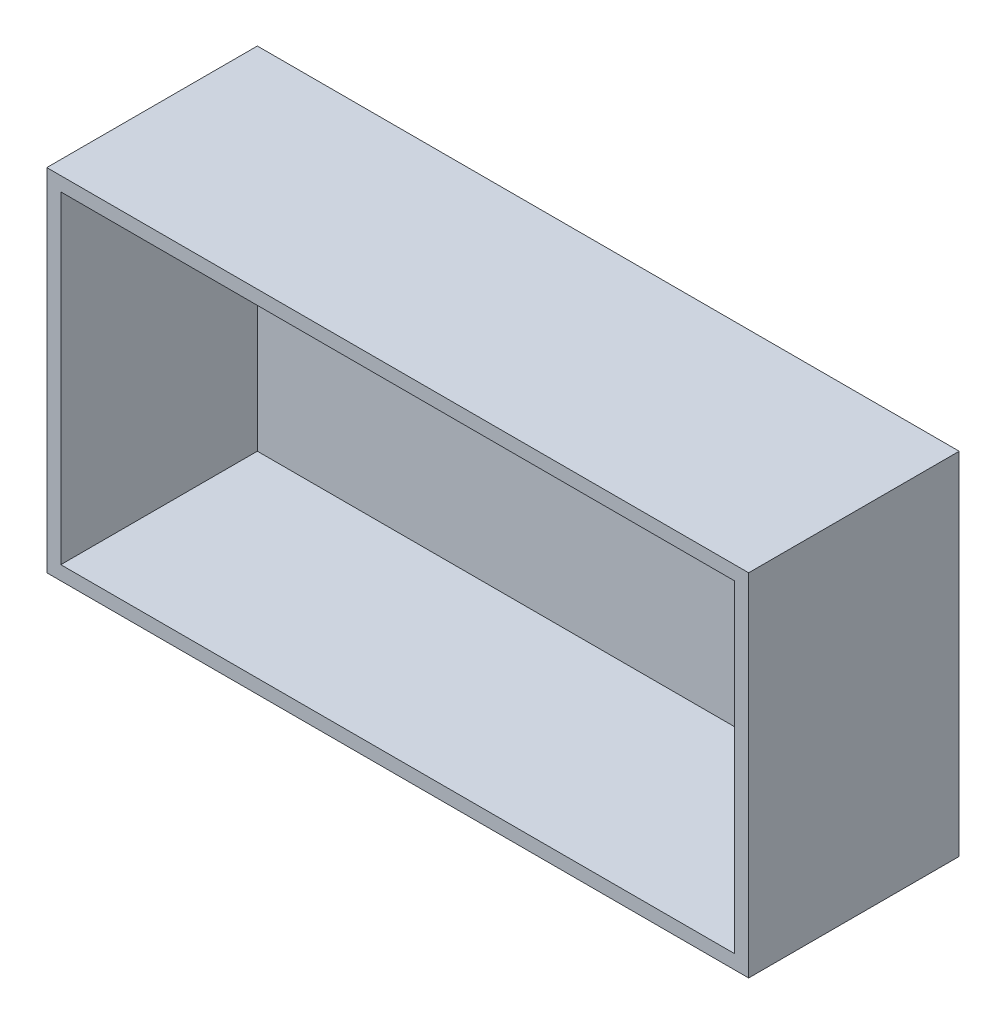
ISO-10303-21;
HEADER;
FILE_DESCRIPTION(('STEP AP214'),'2;1');
FILE_NAME('part.step','',(''),(''),'','','');
FILE_SCHEMA(('AUTOMOTIVE_DESIGN { 1 0 10303 214 1 1 1 1 }'));
ENDSEC;
DATA;
#1=APPLICATION_CONTEXT('core data for automotive mechanical design processes');
#2=APPLICATION_PROTOCOL_DEFINITION('international standard','automotive_design',2000,#1);
#3=PRODUCT_CONTEXT('',#1,'mechanical');
#4=PRODUCT('Part','Part','',(#3));
#5=PRODUCT_RELATED_PRODUCT_CATEGORY('part','',(#4));
#6=PRODUCT_DEFINITION_FORMATION('','',#4);
#7=PRODUCT_DEFINITION_CONTEXT('part definition',#1,'design');
#8=PRODUCT_DEFINITION('design','',#6,#7);
#9=PRODUCT_DEFINITION_SHAPE('','',#8);
#10=(LENGTH_UNIT() NAMED_UNIT(*) SI_UNIT(.MILLI.,.METRE.));
#11=(NAMED_UNIT(*) PLANE_ANGLE_UNIT() SI_UNIT($,.RADIAN.));
#12=(NAMED_UNIT(*) SI_UNIT($,.STERADIAN.) SOLID_ANGLE_UNIT());
#13=UNCERTAINTY_MEASURE_WITH_UNIT(LENGTH_MEASURE(1.E-05),#10,'distance_accuracy_value','');
#14=(GEOMETRIC_REPRESENTATION_CONTEXT(3) GLOBAL_UNCERTAINTY_ASSIGNED_CONTEXT((#13)) GLOBAL_UNIT_ASSIGNED_CONTEXT((#10,
#11,#12)) REPRESENTATION_CONTEXT('',''));
#15=CARTESIAN_POINT('',(0.,0.,0.));
#16=DIRECTION('',(0.,0.,1.));
#17=DIRECTION('',(1.,0.,0.));
#18=AXIS2_PLACEMENT_3D('',#15,#16,#17);
#19=CARTESIAN_POINT('',(100.,50.,60.));
#20=DIRECTION('',(-1.,0.,0.));
#21=DIRECTION('',(0.,-1.,0.));
#22=AXIS2_PLACEMENT_3D('',#19,#20,#21);
#23=PLANE('',#22);
#24=DIRECTION('',(0.,1.,0.));
#25=VECTOR('',#24,1.);
#26=CARTESIAN_POINT('',(100.,50.,0.));
#27=LINE('',#26,#25);
#28=CARTESIAN_POINT('',(100.,-50.,0.));
#29=VERTEX_POINT('',#28);
#30=CARTESIAN_POINT('',(100.,50.,0.));
#31=VERTEX_POINT('',#30);
#32=EDGE_CURVE('E149',#29,#31,#27,.T.);
#33=ORIENTED_EDGE('',*,*,#32,.T.);
#34=DIRECTION('',(0.,0.,-1.));
#35=VECTOR('',#34,1.);
#36=CARTESIAN_POINT('',(100.,50.,60.));
#37=LINE('',#36,#35);
#38=CARTESIAN_POINT('',(100.,50.,60.));
#39=VERTEX_POINT('',#38);
#40=EDGE_CURVE('E11',#39,#31,#37,.T.);
#41=ORIENTED_EDGE('',*,*,#40,.F.);
#42=DIRECTION('',(0.,1.,0.));
#43=VECTOR('',#42,1.);
#44=CARTESIAN_POINT('',(100.,50.,60.));
#45=LINE('',#44,#43);
#46=CARTESIAN_POINT('',(100.,-50.,60.));
#47=VERTEX_POINT('',#46);
#48=EDGE_CURVE('E142',#47,#39,#45,.T.);
#49=ORIENTED_EDGE('',*,*,#48,.F.);
#50=DIRECTION('',(0.,0.,-1.));
#51=VECTOR('',#50,1.);
#52=CARTESIAN_POINT('',(100.,-50.,60.));
#53=LINE('',#52,#51);
#54=EDGE_CURVE('E148',#47,#29,#53,.T.);
#55=ORIENTED_EDGE('',*,*,#54,.T.);
#56=EDGE_LOOP('',(#33,#41,#49,#55));
#57=FACE_BOUND('',#56,.T.);
#58=ADVANCED_FACE('F35',(#57),#23,.F.);
#59=CARTESIAN_POINT('',(-100.,50.,60.));
#60=DIRECTION('',(0.,-1.,0.));
#61=DIRECTION('',(0.,0.,-1.));
#62=AXIS2_PLACEMENT_3D('',#59,#60,#61);
#63=PLANE('',#62);
#64=DIRECTION('',(-1.,0.,0.));
#65=VECTOR('',#64,1.);
#66=CARTESIAN_POINT('',(-100.,50.,0.));
#67=LINE('',#66,#65);
#68=CARTESIAN_POINT('',(-100.,50.,0.));
#69=VERTEX_POINT('',#68);
#70=EDGE_CURVE('E152',#31,#69,#67,.T.);
#71=ORIENTED_EDGE('',*,*,#70,.T.);
#72=DIRECTION('',(0.,0.,-1.));
#73=VECTOR('',#72,1.);
#74=CARTESIAN_POINT('',(-100.,50.,60.));
#75=LINE('',#74,#73);
#76=CARTESIAN_POINT('',(-100.,50.,60.));
#77=VERTEX_POINT('',#76);
#78=EDGE_CURVE('E42',#77,#69,#75,.T.);
#79=ORIENTED_EDGE('',*,*,#78,.F.);
#80=DIRECTION('',(-1.,0.,0.));
#81=VECTOR('',#80,1.);
#82=CARTESIAN_POINT('',(-100.,50.,60.));
#83=LINE('',#82,#81);
#84=EDGE_CURVE('E86',#39,#77,#83,.T.);
#85=ORIENTED_EDGE('',*,*,#84,.F.);
#86=ORIENTED_EDGE('',*,*,#40,.T.);
#87=EDGE_LOOP('',(#71,#79,#85,#86));
#88=FACE_BOUND('',#87,.T.);
#89=ADVANCED_FACE('F181',(#88),#63,.F.);
#90=CARTESIAN_POINT('',(-100.,50.,60.));
#91=DIRECTION('',(1.,0.,0.));
#92=DIRECTION('',(0.,1.,0.));
#93=AXIS2_PLACEMENT_3D('',#90,#91,#92);
#94=PLANE('',#93);
#95=DIRECTION('',(0.,-1.,0.));
#96=VECTOR('',#95,1.);
#97=CARTESIAN_POINT('',(-100.,50.,0.));
#98=LINE('',#97,#96);
#99=CARTESIAN_POINT('',(-100.,-50.,0.));
#100=VERTEX_POINT('',#99);
#101=EDGE_CURVE('E154',#69,#100,#98,.T.);
#102=ORIENTED_EDGE('',*,*,#101,.T.);
#103=DIRECTION('',(0.,0.,-1.));
#104=VECTOR('',#103,1.);
#105=CARTESIAN_POINT('',(-100.,-50.,60.));
#106=LINE('',#105,#104);
#107=CARTESIAN_POINT('',(-100.,-50.,60.));
#108=VERTEX_POINT('',#107);
#109=EDGE_CURVE('E158',#108,#100,#106,.T.);
#110=ORIENTED_EDGE('',*,*,#109,.F.);
#111=DIRECTION('',(0.,-1.,0.));
#112=VECTOR('',#111,1.);
#113=CARTESIAN_POINT('',(-100.,50.,60.));
#114=LINE('',#113,#112);
#115=EDGE_CURVE('E145',#77,#108,#114,.T.);
#116=ORIENTED_EDGE('',*,*,#115,.F.);
#117=ORIENTED_EDGE('',*,*,#78,.T.);
#118=EDGE_LOOP('',(#102,#110,#116,#117));
#119=FACE_BOUND('',#118,.T.);
#120=ADVANCED_FACE('F163',(#119),#94,.F.);
#121=CARTESIAN_POINT('',(-100.,-50.,60.));
#122=DIRECTION('',(0.,1.,0.));
#123=DIRECTION('',(0.,0.,1.));
#124=AXIS2_PLACEMENT_3D('',#121,#122,#123);
#125=PLANE('',#124);
#126=DIRECTION('',(1.,0.,0.));
#127=VECTOR('',#126,1.);
#128=CARTESIAN_POINT('',(-100.,-50.,0.));
#129=LINE('',#128,#127);
#130=EDGE_CURVE('E79',#100,#29,#129,.T.);
#131=ORIENTED_EDGE('',*,*,#130,.T.);
#132=ORIENTED_EDGE('',*,*,#54,.F.);
#133=DIRECTION('',(1.,0.,0.));
#134=VECTOR('',#133,1.);
#135=CARTESIAN_POINT('',(-100.,-50.,60.));
#136=LINE('',#135,#134);
#137=EDGE_CURVE('E58',#108,#47,#136,.T.);
#138=ORIENTED_EDGE('',*,*,#137,.F.);
#139=ORIENTED_EDGE('',*,*,#109,.T.);
#140=EDGE_LOOP('',(#131,#132,#138,#139));
#141=FACE_BOUND('',#140,.T.);
#142=ADVANCED_FACE('F171',(#141),#125,.F.);
#143=CARTESIAN_POINT('',(0.,0.,60.));
#144=DIRECTION('',(0.,0.,1.));
#145=DIRECTION('',(1.,0.,0.));
#146=AXIS2_PLACEMENT_3D('',#143,#144,#145);
#147=PLANE('',#146);
#148=DIRECTION('',(0.,1.,0.));
#149=VECTOR('',#148,1.);
#150=CARTESIAN_POINT('',(96.,50.,60.));
#151=LINE('',#150,#149);
#152=CARTESIAN_POINT('',(96.,-46.,60.));
#153=VERTEX_POINT('',#152);
#154=CARTESIAN_POINT('',(96.,46.,60.));
#155=VERTEX_POINT('',#154);
#156=EDGE_CURVE('E131',#153,#155,#151,.T.);
#157=ORIENTED_EDGE('',*,*,#156,.F.);
#158=DIRECTION('',(1.,0.,0.));
#159=VECTOR('',#158,1.);
#160=CARTESIAN_POINT('',(-100.,-46.,60.));
#161=LINE('',#160,#159);
#162=CARTESIAN_POINT('',(-96.,-46.,60.));
#163=VERTEX_POINT('',#162);
#164=EDGE_CURVE('E140',#163,#153,#161,.T.);
#165=ORIENTED_EDGE('',*,*,#164,.F.);
#166=DIRECTION('',(0.,-1.,0.));
#167=VECTOR('',#166,1.);
#168=CARTESIAN_POINT('',(-96.,50.,60.));
#169=LINE('',#168,#167);
#170=CARTESIAN_POINT('',(-96.,46.,60.));
#171=VERTEX_POINT('',#170);
#172=EDGE_CURVE('E138',#171,#163,#169,.T.);
#173=ORIENTED_EDGE('',*,*,#172,.F.);
#174=DIRECTION('',(-1.,0.,0.));
#175=VECTOR('',#174,1.);
#176=CARTESIAN_POINT('',(-100.,46.,60.));
#177=LINE('',#176,#175);
#178=EDGE_CURVE('E123',#155,#171,#177,.T.);
#179=ORIENTED_EDGE('',*,*,#178,.F.);
#180=EDGE_LOOP('',(#157,#165,#173,#179));
#181=FACE_BOUND('',#180,.T.);
#182=ORIENTED_EDGE('',*,*,#48,.T.);
#183=ORIENTED_EDGE('',*,*,#84,.T.);
#184=ORIENTED_EDGE('',*,*,#115,.T.);
#185=ORIENTED_EDGE('',*,*,#137,.T.);
#186=EDGE_LOOP('',(#182,#183,#184,#185));
#187=FACE_BOUND('',#186,.T.);
#188=ADVANCED_FACE('F173',(#181,#187),#147,.T.);
#189=CARTESIAN_POINT('',(0.,0.,0.));
#190=DIRECTION('',(0.,0.,1.));
#191=DIRECTION('',(1.,0.,0.));
#192=AXIS2_PLACEMENT_3D('',#189,#190,#191);
#193=PLANE('',#192);
#194=ORIENTED_EDGE('',*,*,#32,.F.);
#195=ORIENTED_EDGE('',*,*,#130,.F.);
#196=ORIENTED_EDGE('',*,*,#101,.F.);
#197=ORIENTED_EDGE('',*,*,#70,.F.);
#198=EDGE_LOOP('',(#194,#195,#196,#197));
#199=FACE_BOUND('',#198,.T.);
#200=ADVANCED_FACE('F167',(#199),#193,.F.);
#201=CARTESIAN_POINT('',(96.,50.,60.));
#202=DIRECTION('',(-1.,0.,0.));
#203=DIRECTION('',(0.,-1.,0.));
#204=AXIS2_PLACEMENT_3D('',#201,#202,#203);
#205=PLANE('',#204);
#206=DIRECTION('',(0.,1.,0.));
#207=VECTOR('',#206,1.);
#208=CARTESIAN_POINT('',(96.,50.,4.));
#209=LINE('',#208,#207);
#210=CARTESIAN_POINT('',(96.,-46.,4.));
#211=VERTEX_POINT('',#210);
#212=CARTESIAN_POINT('',(96.,46.,4.));
#213=VERTEX_POINT('',#212);
#214=EDGE_CURVE('E114',#211,#213,#209,.T.);
#215=ORIENTED_EDGE('',*,*,#214,.F.);
#216=DIRECTION('',(0.,0.,-1.));
#217=VECTOR('',#216,1.);
#218=CARTESIAN_POINT('',(96.,-46.,60.));
#219=LINE('',#218,#217);
#220=EDGE_CURVE('E134',#153,#211,#219,.T.);
#221=ORIENTED_EDGE('',*,*,#220,.F.);
#222=ORIENTED_EDGE('',*,*,#156,.T.);
#223=DIRECTION('',(0.,0.,-1.));
#224=VECTOR('',#223,1.);
#225=CARTESIAN_POINT('',(96.,46.,60.));
#226=LINE('',#225,#224);
#227=EDGE_CURVE('E126',#155,#213,#226,.T.);
#228=ORIENTED_EDGE('',*,*,#227,.T.);
#229=EDGE_LOOP('',(#215,#221,#222,#228));
#230=FACE_BOUND('',#229,.T.);
#231=ADVANCED_FACE('F208',(#230),#205,.T.);
#232=CARTESIAN_POINT('',(-100.,46.,60.));
#233=DIRECTION('',(0.,-1.,0.));
#234=DIRECTION('',(0.,0.,-1.));
#235=AXIS2_PLACEMENT_3D('',#232,#233,#234);
#236=PLANE('',#235);
#237=DIRECTION('',(-1.,0.,0.));
#238=VECTOR('',#237,1.);
#239=CARTESIAN_POINT('',(-100.,46.,4.));
#240=LINE('',#239,#238);
#241=CARTESIAN_POINT('',(-96.,46.,4.));
#242=VERTEX_POINT('',#241);
#243=EDGE_CURVE('E108',#213,#242,#240,.T.);
#244=ORIENTED_EDGE('',*,*,#243,.F.);
#245=ORIENTED_EDGE('',*,*,#227,.F.);
#246=ORIENTED_EDGE('',*,*,#178,.T.);
#247=DIRECTION('',(0.,0.,-1.));
#248=VECTOR('',#247,1.);
#249=CARTESIAN_POINT('',(-96.,46.,60.));
#250=LINE('',#249,#248);
#251=EDGE_CURVE('E120',#171,#242,#250,.T.);
#252=ORIENTED_EDGE('',*,*,#251,.T.);
#253=EDGE_LOOP('',(#244,#245,#246,#252));
#254=FACE_BOUND('',#253,.T.);
#255=ADVANCED_FACE('F121',(#254),#236,.T.);
#256=CARTESIAN_POINT('',(-96.,50.,60.));
#257=DIRECTION('',(1.,0.,0.));
#258=DIRECTION('',(0.,1.,0.));
#259=AXIS2_PLACEMENT_3D('',#256,#257,#258);
#260=PLANE('',#259);
#261=DIRECTION('',(0.,-1.,0.));
#262=VECTOR('',#261,1.);
#263=CARTESIAN_POINT('',(-96.,50.,4.));
#264=LINE('',#263,#262);
#265=CARTESIAN_POINT('',(-96.,-46.,4.));
#266=VERTEX_POINT('',#265);
#267=EDGE_CURVE('E112',#242,#266,#264,.T.);
#268=ORIENTED_EDGE('',*,*,#267,.F.);
#269=ORIENTED_EDGE('',*,*,#251,.F.);
#270=ORIENTED_EDGE('',*,*,#172,.T.);
#271=DIRECTION('',(0.,0.,-1.));
#272=VECTOR('',#271,1.);
#273=CARTESIAN_POINT('',(-96.,-46.,60.));
#274=LINE('',#273,#272);
#275=EDGE_CURVE('E49',#163,#266,#274,.T.);
#276=ORIENTED_EDGE('',*,*,#275,.T.);
#277=EDGE_LOOP('',(#268,#269,#270,#276));
#278=FACE_BOUND('',#277,.T.);
#279=ADVANCED_FACE('F128',(#278),#260,.T.);
#280=CARTESIAN_POINT('',(-100.,-46.,60.));
#281=DIRECTION('',(0.,1.,0.));
#282=DIRECTION('',(0.,0.,1.));
#283=AXIS2_PLACEMENT_3D('',#280,#281,#282);
#284=PLANE('',#283);
#285=DIRECTION('',(1.,0.,0.));
#286=VECTOR('',#285,1.);
#287=CARTESIAN_POINT('',(-100.,-46.,4.));
#288=LINE('',#287,#286);
#289=EDGE_CURVE('E129',#266,#211,#288,.T.);
#290=ORIENTED_EDGE('',*,*,#289,.F.);
#291=ORIENTED_EDGE('',*,*,#275,.F.);
#292=ORIENTED_EDGE('',*,*,#164,.T.);
#293=ORIENTED_EDGE('',*,*,#220,.T.);
#294=EDGE_LOOP('',(#290,#291,#292,#293));
#295=FACE_BOUND('',#294,.T.);
#296=ADVANCED_FACE('F238',(#295),#284,.T.);
#297=CARTESIAN_POINT('',(0.,0.,4.));
#298=DIRECTION('',(0.,0.,1.));
#299=DIRECTION('',(1.,0.,0.));
#300=AXIS2_PLACEMENT_3D('',#297,#298,#299);
#301=PLANE('',#300);
#302=ORIENTED_EDGE('',*,*,#214,.T.);
#303=ORIENTED_EDGE('',*,*,#243,.T.);
#304=ORIENTED_EDGE('',*,*,#267,.T.);
#305=ORIENTED_EDGE('',*,*,#289,.T.);
#306=EDGE_LOOP('',(#302,#303,#304,#305));
#307=FACE_BOUND('',#306,.T.);
#308=ADVANCED_FACE('F110',(#307),#301,.T.);
#309=CLOSED_SHELL('',(#58,#89,#120,#142,#188,#200,#231,#255,#279,#296,#308));
#310=MANIFOLD_SOLID_BREP('B2',#309);
#311=ADVANCED_BREP_SHAPE_REPRESENTATION('',(#18,#310),#14);
#312=SHAPE_DEFINITION_REPRESENTATION(#9,#311);
ENDSEC;
END-ISO-10303-21;
